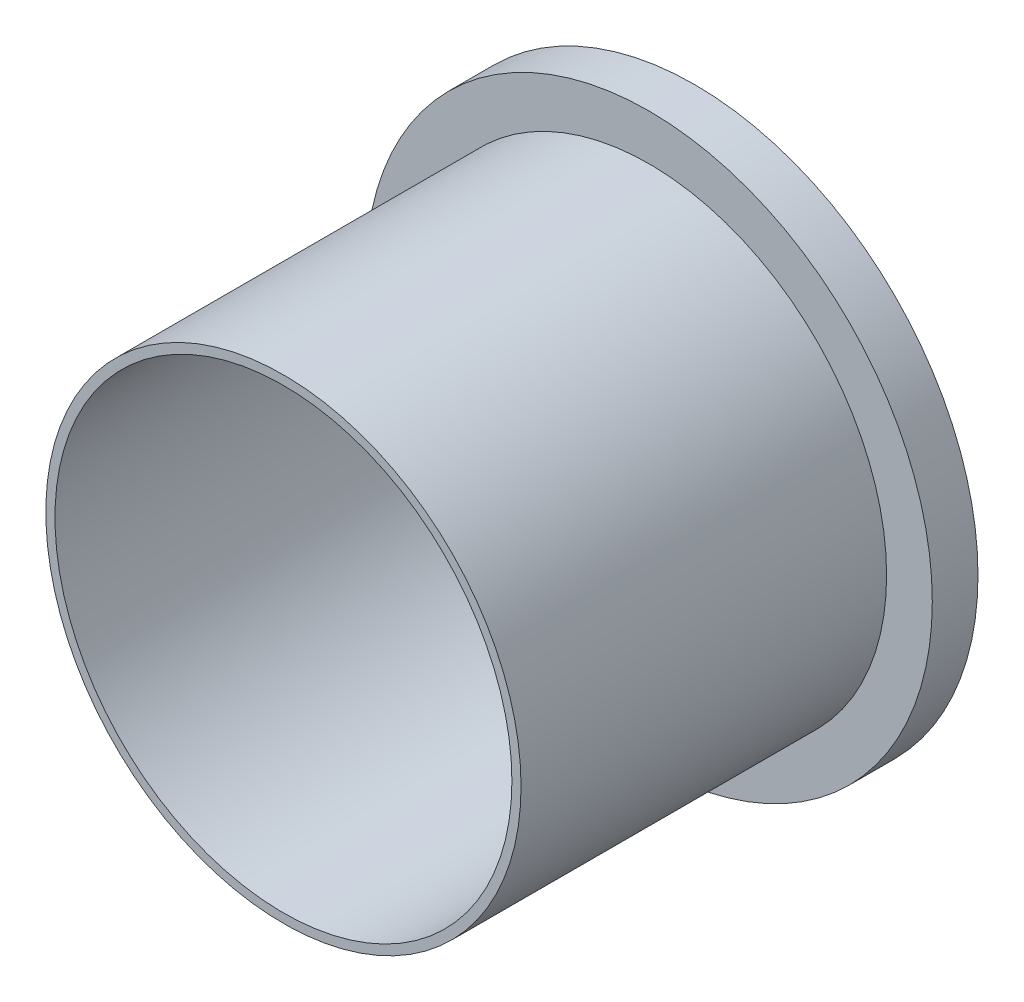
ISO-10303-21;
HEADER;
FILE_DESCRIPTION(('STEP AP214'),'2;1');
FILE_NAME('part.step','',(''),(''),'','','');
FILE_SCHEMA(('AUTOMOTIVE_DESIGN { 1 0 10303 214 1 1 1 1 }'));
ENDSEC;
DATA;
#1=APPLICATION_CONTEXT('core data for automotive mechanical design processes');
#2=APPLICATION_PROTOCOL_DEFINITION('international standard','automotive_design',2000,#1);
#3=PRODUCT_CONTEXT('',#1,'mechanical');
#4=PRODUCT('Part','Part','',(#3));
#5=PRODUCT_RELATED_PRODUCT_CATEGORY('part','',(#4));
#6=PRODUCT_DEFINITION_FORMATION('','',#4);
#7=PRODUCT_DEFINITION_CONTEXT('part definition',#1,'design');
#8=PRODUCT_DEFINITION('design','',#6,#7);
#9=PRODUCT_DEFINITION_SHAPE('','',#8);
#10=(LENGTH_UNIT() NAMED_UNIT(*) SI_UNIT(.MILLI.,.METRE.));
#11=(NAMED_UNIT(*) PLANE_ANGLE_UNIT() SI_UNIT($,.RADIAN.));
#12=(NAMED_UNIT(*) SI_UNIT($,.STERADIAN.) SOLID_ANGLE_UNIT());
#13=UNCERTAINTY_MEASURE_WITH_UNIT(LENGTH_MEASURE(1.E-05),#10,'distance_accuracy_value','');
#14=(GEOMETRIC_REPRESENTATION_CONTEXT(3) GLOBAL_UNCERTAINTY_ASSIGNED_CONTEXT((#13)) GLOBAL_UNIT_ASSIGNED_CONTEXT((#10,
#11,#12)) REPRESENTATION_CONTEXT('',''));
#15=CARTESIAN_POINT('',(0.,0.,0.));
#16=DIRECTION('',(0.,0.,1.));
#17=DIRECTION('',(1.,0.,0.));
#18=AXIS2_PLACEMENT_3D('',#15,#16,#17);
#19=CARTESIAN_POINT('',(0.,0.,5.));
#20=DIRECTION('',(0.,0.,-1.));
#21=DIRECTION('',(-1.,0.,0.));
#22=AXIS2_PLACEMENT_3D('',#19,#20,#21);
#23=CYLINDRICAL_SURFACE('',#22,31.);
#24=CARTESIAN_POINT('',(0.,0.,5.));
#25=DIRECTION('',(0.,0.,1.));
#26=DIRECTION('',(1.,0.,0.));
#27=AXIS2_PLACEMENT_3D('',#24,#25,#26);
#28=CIRCLE('',#27,31.);
#29=CARTESIAN_POINT('',(31.,0.,5.));
#30=VERTEX_POINT('',#29);
#31=EDGE_CURVE('E104',#30,#30,#28,.T.);
#32=ORIENTED_EDGE('',*,*,#31,.F.);
#33=EDGE_LOOP('',(#32));
#34=FACE_BOUND('',#33,.T.);
#35=CARTESIAN_POINT('',(0.,0.,0.));
#36=DIRECTION('',(0.,0.,1.));
#37=DIRECTION('',(1.,0.,0.));
#38=AXIS2_PLACEMENT_3D('',#35,#36,#37);
#39=CIRCLE('',#38,31.);
#40=CARTESIAN_POINT('',(31.,0.,0.));
#41=VERTEX_POINT('',#40);
#42=EDGE_CURVE('E78',#41,#41,#39,.T.);
#43=ORIENTED_EDGE('',*,*,#42,.T.);
#44=EDGE_LOOP('',(#43));
#45=FACE_BOUND('',#44,.T.);
#46=ADVANCED_FACE('F41',(#34,#45),#23,.T.);
#47=CARTESIAN_POINT('',(0.,0.,5.));
#48=DIRECTION('',(0.,0.,1.));
#49=DIRECTION('',(1.,0.,0.));
#50=AXIS2_PLACEMENT_3D('',#47,#48,#49);
#51=PLANE('',#50);
#52=CARTESIAN_POINT('',(0.,0.,5.));
#53=DIRECTION('',(0.,0.,1.));
#54=DIRECTION('',(1.,0.,0.));
#55=AXIS2_PLACEMENT_3D('',#52,#53,#54);
#56=CIRCLE('',#55,26.);
#57=CARTESIAN_POINT('',(26.,0.,5.));
#58=VERTEX_POINT('',#57);
#59=EDGE_CURVE('E49',#58,#58,#56,.T.);
#60=ORIENTED_EDGE('',*,*,#59,.F.);
#61=EDGE_LOOP('',(#60));
#62=FACE_BOUND('',#61,.T.);
#63=ORIENTED_EDGE('',*,*,#31,.T.);
#64=EDGE_LOOP('',(#63));
#65=FACE_BOUND('',#64,.T.);
#66=ADVANCED_FACE('F115',(#62,#65),#51,.T.);
#67=CARTESIAN_POINT('',(0.,0.,0.));
#68=DIRECTION('',(0.,0.,1.));
#69=DIRECTION('',(1.,0.,0.));
#70=AXIS2_PLACEMENT_3D('',#67,#68,#69);
#71=PLANE('',#70);
#72=CARTESIAN_POINT('',(0.,-26.7712106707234,0.));
#73=CARTESIAN_POINT('',(0.0951690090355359,-26.7712114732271,0.));
#74=CARTESIAN_POINT('',(0.190332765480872,-26.7667476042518,0.));
#75=CARTESIAN_POINT('',(0.379827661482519,-26.7490256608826,0.));
#76=CARTESIAN_POINT('',(0.474158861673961,-26.7357682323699,0.));
#77=CARTESIAN_POINT('',(0.661290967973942,-26.7008198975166,0.));
#78=CARTESIAN_POINT('',(0.754090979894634,-26.6791242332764,0.));
#79=CARTESIAN_POINT('',(0.937523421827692,-26.6278483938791,0.));
#80=CARTESIAN_POINT('',(1.02815463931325,-26.5982639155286,0.));
#81=CARTESIAN_POINT('',(1.22597101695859,-26.5247352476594,0.));
#82=CARTESIAN_POINT('',(1.33251701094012,-26.4790706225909,0.));
#83=CARTESIAN_POINT('',(1.54113763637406,-26.3783751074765,0.));
#84=CARTESIAN_POINT('',(1.64320897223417,-26.3233374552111,0.));
#85=CARTESIAN_POINT('',(1.84267739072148,-26.2051233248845,0.));
#86=CARTESIAN_POINT('',(1.94006822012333,-26.1419363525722,0.));
#87=CARTESIAN_POINT('',(2.12994875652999,-26.0086769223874,0.));
#88=CARTESIAN_POINT('',(2.22243956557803,-25.9386060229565,0.));
#89=CARTESIAN_POINT('',(2.45528216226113,-25.7499416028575,0.));
#90=CARTESIAN_POINT('',(2.59204397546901,-25.626906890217,0.));
#91=CARTESIAN_POINT('',(2.85435071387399,-25.3694101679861,0.));
#92=CARTESIAN_POINT('',(2.9798886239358,-25.2349411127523,0.));
#93=CARTESIAN_POINT('',(3.22084267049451,-24.9568653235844,0.));
#94=CARTESIAN_POINT('',(3.33624079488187,-24.8132430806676,0.));
#95=CARTESIAN_POINT('',(3.55764854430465,-24.5188962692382,0.));
#96=CARTESIAN_POINT('',(3.66365454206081,-24.3681689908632,0.));
#97=CARTESIAN_POINT('',(3.86296268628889,-24.0673134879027,0.));
#98=CARTESIAN_POINT('',(3.95660615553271,-23.9174101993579,0.));
#99=CARTESIAN_POINT('',(4.13666570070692,-23.6133783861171,0.));
#100=CARTESIAN_POINT('',(4.22308282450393,-23.4592504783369,0.));
#101=CARTESIAN_POINT('',(4.47257501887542,-22.9913566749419,0.));
#102=CARTESIAN_POINT('',(4.6257563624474,-22.6722886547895,0.));
#103=CARTESIAN_POINT('',(4.9097172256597,-22.0238877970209,0.));
#104=CARTESIAN_POINT('',(5.04045959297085,-21.6945389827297,0.));
#105=CARTESIAN_POINT('',(5.2820764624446,-21.0287745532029,0.));
#106=CARTESIAN_POINT('',(5.392956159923,-20.6923608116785,0.));
#107=CARTESIAN_POINT('',(5.59467986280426,-20.0219947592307,0.));
#108=CARTESIAN_POINT('',(5.68592355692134,-19.6881616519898,0.));
#109=CARTESIAN_POINT('',(5.85301692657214,-19.0166247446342,0.));
#110=CARTESIAN_POINT('',(5.92886393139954,-18.67892028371,0.));
#111=CARTESIAN_POINT('',(6.06633136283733,-18.0003672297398,0.));
#112=CARTESIAN_POINT('',(6.12794051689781,-17.6595163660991,0.));
#113=CARTESIAN_POINT('',(6.23770548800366,-16.9756860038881,0.));
#114=CARTESIAN_POINT('',(6.2858620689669,-16.6327066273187,0.));
#115=CARTESIAN_POINT('',(6.3694937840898,-15.9440382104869,0.));
#116=CARTESIAN_POINT('',(6.40492559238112,-15.5983439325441,0.));
#117=CARTESIAN_POINT('',(6.46332318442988,-14.9059013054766,0.));
#118=CARTESIAN_POINT('',(6.48628867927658,-14.5591529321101,0.));
#119=CARTESIAN_POINT('',(6.5200224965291,-13.8652237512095,0.));
#120=CARTESIAN_POINT('',(6.53079641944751,-13.5180432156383,0.));
#121=CARTESIAN_POINT('',(6.54029122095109,-12.8235401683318,0.));
#122=CARTESIAN_POINT('',(6.53901261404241,-12.4762176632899,0.));
#123=CARTESIAN_POINT('',(6.52122249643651,-11.6310035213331,0.));
#124=CARTESIAN_POINT('',(6.49833642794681,-11.1332312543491,0.));
#125=CARTESIAN_POINT('',(6.42719860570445,-10.1393540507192,0.));
#126=CARTESIAN_POINT('',(6.37893960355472,-9.64324963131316,0.));
#127=CARTESIAN_POINT('',(6.25575660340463,-8.65384936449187,0.));
#128=CARTESIAN_POINT('',(6.18080672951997,-8.16055671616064,0.));
#129=CARTESIAN_POINT('',(6.00252804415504,-7.18093065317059,0.));
#130=CARTESIAN_POINT('',(5.89930666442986,-6.69457808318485,0.));
#131=CARTESIAN_POINT('',(5.72080350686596,-5.97110568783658,0.));
#132=CARTESIAN_POINT('',(5.6573790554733,-5.73102625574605,0.));
#133=CARTESIAN_POINT('',(5.52209099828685,-5.25326547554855,0.));
#134=CARTESIAN_POINT('',(5.45022819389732,-5.01558390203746,0.));
#135=CARTESIAN_POINT('',(5.29753705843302,-4.54349751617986,0.));
#136=CARTESIAN_POINT('',(5.21672219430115,-4.30908836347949,0.));
#137=CARTESIAN_POINT('',(5.04526857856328,-3.84391383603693,0.));
#138=CARTESIAN_POINT('',(4.95463115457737,-3.61314797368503,0.));
#139=CARTESIAN_POINT('',(4.74871149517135,-3.12314981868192,0.));
#140=CARTESIAN_POINT('',(4.63176023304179,-2.864612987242,0.));
#141=CARTESIAN_POINT('',(4.38189982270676,-2.35519685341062,0.));
#142=CARTESIAN_POINT('',(4.24898557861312,-2.10432002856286,0.));
#143=CARTESIAN_POINT('',(3.96565607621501,-1.6141910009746,0.));
#144=CARTESIAN_POINT('',(3.81532860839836,-1.37488842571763,0.));
#145=CARTESIAN_POINT('',(3.49396375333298,-0.910684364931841,0.));
#146=CARTESIAN_POINT('',(3.32294855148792,-0.685767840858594,0.));
#147=CARTESIAN_POINT('',(3.06066738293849,-0.378078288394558,0.));
#148=CARTESIAN_POINT('',(2.97912570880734,-0.286981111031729,0.));
#149=CARTESIAN_POINT('',(2.8112676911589,-0.109338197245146,0.));
#150=CARTESIAN_POINT('',(2.72495175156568,-0.0227920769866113,0.));
#151=CARTESIAN_POINT('',(2.4580954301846,0.229137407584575,0.));
#152=CARTESIAN_POINT('',(2.26978250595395,0.386648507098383,0.));
#153=CARTESIAN_POINT('',(1.96980155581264,0.601276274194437,0.));
#154=CARTESIAN_POINT('',(1.86608154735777,0.669622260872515,0.));
#155=CARTESIAN_POINT('',(1.65308171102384,0.797158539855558,0.));
#156=CARTESIAN_POINT('',(1.54380144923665,0.856348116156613,0.));
#157=CARTESIAN_POINT('',(1.32035538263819,0.963817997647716,0.));
#158=CARTESIAN_POINT('',(1.20620442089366,1.01212897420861,0.));
#159=CARTESIAN_POINT('',(0.973445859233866,1.09643506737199,0.));
#160=CARTESIAN_POINT('',(0.854840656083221,1.13243670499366,0.));
#161=CARTESIAN_POINT('',(0.649624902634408,1.18216255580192,0.));
#162=CARTESIAN_POINT('',(0.563836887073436,1.19932381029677,0.));
#163=CARTESIAN_POINT('',(0.391133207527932,1.22642002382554,0.));
#164=CARTESIAN_POINT('',(0.304217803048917,1.2363566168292,0.));
#165=CARTESIAN_POINT('',(0.129879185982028,1.24876450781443,0.));
#166=CARTESIAN_POINT('',(0.0424561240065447,1.25123791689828,0.));
#167=CARTESIAN_POINT('',(-0.132282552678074,1.24866604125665,0.));
#168=CARTESIAN_POINT('',(-0.219598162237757,1.24362040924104,0.));
#169=CARTESIAN_POINT('',(-0.393336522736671,1.22614597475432,0.));
#170=CARTESIAN_POINT('',(-0.479760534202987,1.21372967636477,0.));
#171=CARTESIAN_POINT('',(-0.651272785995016,1.18182544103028,0.));
#172=CARTESIAN_POINT('',(-0.736361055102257,1.16233765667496,0.));
#173=CARTESIAN_POINT('',(-0.988955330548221,1.09385233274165,0.));
#174=CARTESIAN_POINT('',(-1.15379596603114,1.03483226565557,0.));
#175=CARTESIAN_POINT('',(-1.53861254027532,0.865728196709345,0.));
#176=CARTESIAN_POINT('',(-1.75371797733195,0.744637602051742,0.));
#177=CARTESIAN_POINT('',(-2.05975541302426,0.538884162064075,0.));
#178=CARTESIAN_POINT('',(-2.15914133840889,0.466146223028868,0.));
#179=CARTESIAN_POINT('',(-2.35252428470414,0.313812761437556,0.));
#180=CARTESIAN_POINT('',(-2.44652194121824,0.234218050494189,0.));
#181=CARTESIAN_POINT('',(-2.68873400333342,0.0156254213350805,0.));
#182=CARTESIAN_POINT('',(-2.83245865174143,-0.128345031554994,0.));
#183=CARTESIAN_POINT('',(-3.10692755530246,-0.428187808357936,0.));
#184=CARTESIAN_POINT('',(-3.23766277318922,-0.584068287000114,0.));
#185=CARTESIAN_POINT('',(-3.48756141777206,-0.905181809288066,0.));
#186=CARTESIAN_POINT('',(-3.60670612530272,-1.07042932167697,0.));
#187=CARTESIAN_POINT('',(-3.83442309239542,-1.40809818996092,0.));
#188=CARTESIAN_POINT('',(-3.94299127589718,-1.58052227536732,0.));
#189=CARTESIAN_POINT('',(-4.14848151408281,-1.92750753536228,0.));
#190=CARTESIAN_POINT('',(-4.24559288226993,-2.10195722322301,0.));
#191=CARTESIAN_POINT('',(-4.43145393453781,-2.45520568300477,0.));
#192=CARTESIAN_POINT('',(-4.52020475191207,-2.63400386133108,0.));
#193=CARTESIAN_POINT('',(-4.69015075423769,-2.99532822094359,0.));
#194=CARTESIAN_POINT('',(-4.77133949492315,-3.17785742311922,0.));
#195=CARTESIAN_POINT('',(-4.92668726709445,-3.54589207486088,0.));
#196=CARTESIAN_POINT('',(-5.0008454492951,-3.73139788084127,0.));
#197=CARTESIAN_POINT('',(-5.2138349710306,-4.29232953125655,0.));
#198=CARTESIAN_POINT('',(-5.34287283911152,-4.671501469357,0.));
#199=CARTESIAN_POINT('',(-5.57802847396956,-5.43664984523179,0.));
#200=CARTESIAN_POINT('',(-5.68415241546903,-5.82262441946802,0.));
#201=CARTESIAN_POINT('',(-5.90016924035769,-6.69799218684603,0.));
#202=CARTESIAN_POINT('',(-6.00421430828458,-7.18882885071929,0.));
#203=CARTESIAN_POINT('',(-6.1833661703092,-8.17602292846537,0.));
#204=CARTESIAN_POINT('',(-6.25845275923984,-8.67238394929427,0.));
#205=CARTESIAN_POINT('',(-6.38169160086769,-9.66861343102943,0.));
#206=CARTESIAN_POINT('',(-6.42983313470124,-10.1684832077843,0.));
#207=CARTESIAN_POINT('',(-6.50042986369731,-11.1706885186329,0.));
#208=CARTESIAN_POINT('',(-6.52285052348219,-11.6730264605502,0.));
#209=CARTESIAN_POINT('',(-6.54244382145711,-12.6779650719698,0.));
#210=CARTESIAN_POINT('',(-6.53962778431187,-13.1805655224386,0.));
#211=CARTESIAN_POINT('',(-6.5087094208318,-14.1848338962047,0.));
#212=CARTESIAN_POINT('',(-6.48061517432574,-14.6865020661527,0.));
#213=CARTESIAN_POINT('',(-6.39592815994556,-15.7184701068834,0.));
#214=CARTESIAN_POINT('',(-6.337691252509,-16.2486363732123,0.));
#215=CARTESIAN_POINT('',(-6.19021999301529,-17.3048453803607,0.));
#216=CARTESIAN_POINT('',(-6.10097954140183,-17.8308872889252,0.));
#217=CARTESIAN_POINT('',(-5.94193028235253,-18.6136232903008,0.));
#218=CARTESIAN_POINT('',(-5.88486120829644,-18.8729451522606,0.));
#219=CARTESIAN_POINT('',(-5.76180510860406,-19.389456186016,0.));
#220=CARTESIAN_POINT('',(-5.69581888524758,-19.6466455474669,0.));
#221=CARTESIAN_POINT('',(-5.55435113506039,-20.1582658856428,0.));
#222=CARTESIAN_POINT('',(-5.47887444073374,-20.4126981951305,0.));
#223=CARTESIAN_POINT('',(-5.31764753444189,-20.918263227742,0.));
#224=CARTESIAN_POINT('',(-5.23189891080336,-21.1693964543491,0.));
#225=CARTESIAN_POINT('',(-5.06415991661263,-21.6267035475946,0.));
#226=CARTESIAN_POINT('',(-4.98385927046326,-21.8334966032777,0.));
#227=CARTESIAN_POINT('',(-4.81473713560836,-22.243573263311,0.));
#228=CARTESIAN_POINT('',(-4.72591605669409,-22.4468570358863,0.));
#229=CARTESIAN_POINT('',(-4.5386674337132,-22.8496930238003,0.));
#230=CARTESIAN_POINT('',(-4.44021262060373,-23.049232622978,0.));
#231=CARTESIAN_POINT('',(-4.23293402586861,-23.442870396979,0.));
#232=CARTESIAN_POINT('',(-4.12411070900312,-23.6369688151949,0.));
#233=CARTESIAN_POINT('',(-3.89345580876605,-24.0206828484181,0.));
#234=CARTESIAN_POINT('',(-3.77147691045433,-24.2102105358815,0.));
#235=CARTESIAN_POINT('',(-3.51415506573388,-24.5801696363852,0.));
#236=CARTESIAN_POINT('',(-3.37880622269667,-24.7605969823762,0.));
#237=CARTESIAN_POINT('',(-3.09374883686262,-25.1085101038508,0.));
#238=CARTESIAN_POINT('',(-2.94410766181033,-25.2760504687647,0.));
#239=CARTESIAN_POINT('',(-2.62844253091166,-25.5946769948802,0.));
#240=CARTESIAN_POINT('',(-2.46244101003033,-25.7457851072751,0.));
#241=CARTESIAN_POINT('',(-2.1240283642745,-26.0165670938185,0.));
#242=CARTESIAN_POINT('',(-1.95278323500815,-26.1376653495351,0.));
#243=CARTESIAN_POINT('',(-1.68421141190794,-26.2998777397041,0.));
#244=CARTESIAN_POINT('',(-1.59271275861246,-26.350719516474,0.));
#245=CARTESIAN_POINT('',(-1.40598961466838,-26.4449825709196,0.));
#246=CARTESIAN_POINT('',(-1.31076691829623,-26.4884073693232,0.));
#247=CARTESIAN_POINT('',(-1.11755645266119,-26.5666296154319,0.));
#248=CARTESIAN_POINT('',(-1.01959112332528,-26.6014821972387,0.));
#249=CARTESIAN_POINT('',(-0.820851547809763,-26.6620211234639,0.));
#250=CARTESIAN_POINT('',(-0.720077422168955,-26.6877078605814,0.));
#251=CARTESIAN_POINT('',(-0.516615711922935,-26.7291210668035,0.));
#252=CARTESIAN_POINT('',(-0.413930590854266,-26.7448595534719,0.));
#253=CARTESIAN_POINT('',(-0.207494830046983,-26.765903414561,0.));
#254=CARTESIAN_POINT('',(-0.103744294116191,-26.7712097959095,0.));
#255=CARTESIAN_POINT('',(0.,-26.7712106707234,0.));
#256=B_SPLINE_CURVE_WITH_KNOTS('',3,(#72,#73,#74,#75,#76,#77,#78,#79,#80,#81,#82,#83,#84,#85,
#86,#87,#88,#89,#90,#91,#92,#93,#94,#95,#96,#97,#98,#99,#100,#101,#102,#103,#104,#105,#106,#107,
#108,#109,#110,#111,#112,#113,#114,#115,#116,#117,#118,#119,#120,#121,#122,#123,#124,#125,#126,
#127,#128,#129,#130,#131,#132,#133,#134,#135,#136,#137,#138,#139,#140,#141,#142,#143,#144,#145,
#146,#147,#148,#149,#150,#151,#152,#153,#154,#155,#156,#157,#158,#159,#160,#161,#162,#163,#164,
#165,#166,#167,#168,#169,#170,#171,#172,#173,#174,#175,#176,#177,#178,#179,#180,#181,#182,#183,
#184,#185,#186,#187,#188,#189,#190,#191,#192,#193,#194,#195,#196,#197,#198,#199,#200,#201,#202,
#203,#204,#205,#206,#207,#208,#209,#210,#211,#212,#213,#214,#215,#216,#217,#218,#219,#220,#221,
#222,#223,#224,#225,#226,#227,#228,#229,#230,#231,#232,#233,#234,#235,#236,#237,#238,#239,#240,
#241,#242,#243,#244,#245,#246,#247,#248,#249,#250,#251,#252,#253,#254,#255),.UNSPECIFIED.,.T.,
.F.,(4,2,2,2,2,2,2,2,2,2,2,2,2,2,2,2,2,2,2,2,2,2,2,2,2,2,2,2,2,2,2,2,2,2,2,2,2,2,2,2,2,2,2,2,2,
2,2,2,2,2,2,2,2,2,2,2,2,2,2,2,2,2,2,2,2,2,2,2,2,2,2,2,2,2,2,2,2,2,2,2,2,2,2,2,2,2,2,2,2,2,2,4),
(0.,0.28539490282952,0.570768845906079,0.856303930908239,1.1419950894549,1.48922227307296,
1.83670103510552,2.18463181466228,2.53248400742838,3.08346014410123,3.63477827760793,
4.18705675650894,4.73954760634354,5.26956916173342,5.79951372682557,6.86014331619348,
7.92251240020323,8.9846032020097,10.0224418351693,11.0604603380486,12.0992978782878,
13.1380764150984,14.1803590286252,15.222665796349,16.264493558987,17.3062768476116,
18.8005120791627,20.2951744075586,21.7912897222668,23.2817968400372,24.0266192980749,
24.7713710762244,25.5150173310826,26.2585631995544,27.1093646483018,27.9604384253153,
28.8073942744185,29.6534497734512,30.0200690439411,30.3866573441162,31.1204684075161,
31.4927484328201,31.8650575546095,32.2363034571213,32.6073523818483,32.8695374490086,
33.1316632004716,33.3937147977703,33.6557784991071,33.9173988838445,34.1790136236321,
34.7022277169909,35.4384222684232,35.8076862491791,36.1769065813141,36.7862104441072,
37.3959352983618,38.0066290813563,38.6175572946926,39.2162821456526,39.8149257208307,
40.4140748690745,41.0132963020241,42.2139417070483,43.4142631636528,44.9184695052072,
46.4237234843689,47.9295758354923,49.4374477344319,50.944643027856,52.4513567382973,
54.0505973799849,55.6501528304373,56.4466068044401,57.2429891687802,58.0389676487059,
58.8348232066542,59.5001655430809,60.1654758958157,60.8327271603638,61.4999485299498,
62.1756216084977,62.8515940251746,63.5245242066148,64.196544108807,64.8237414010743,
65.1374949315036,65.4510991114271,65.762630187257,66.0741479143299,66.385288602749,
66.6963992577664),.UNSPECIFIED.);
#257=CARTESIAN_POINT('',(-5.44374653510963,-5.,0.));
#258=VERTEX_POINT('',#257);
#259=CARTESIAN_POINT('',(5.44374653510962,-5.,0.));
#260=VERTEX_POINT('',#259);
#261=EDGE_CURVE('E54',#258,#260,#256,.T.);
#262=ORIENTED_EDGE('',*,*,#261,.T.);
#263=DIRECTION('',(-1.,0.,0.));
#264=VECTOR('',#263,1.);
#265=CARTESIAN_POINT('',(0.,-5.,0.));
#266=LINE('',#265,#264);
#267=EDGE_CURVE('E11',#260,#258,#266,.T.);
#268=ORIENTED_EDGE('',*,*,#267,.T.);
#269=EDGE_LOOP('',(#262,#268));
#270=FACE_BOUND('',#269,.T.);
#271=ORIENTED_EDGE('',*,*,#42,.F.);
#272=EDGE_LOOP('',(#271));
#273=FACE_BOUND('',#272,.T.);
#274=ADVANCED_FACE('F57',(#270,#273),#71,.F.);
#275=CARTESIAN_POINT('',(0.,0.,45.));
#276=DIRECTION('',(0.,0.,-1.));
#277=DIRECTION('',(-1.,0.,0.));
#278=AXIS2_PLACEMENT_3D('',#275,#276,#277);
#279=CYLINDRICAL_SURFACE('',#278,26.);
#280=CARTESIAN_POINT('',(0.,0.,45.));
#281=DIRECTION('',(0.,0.,1.));
#282=DIRECTION('',(1.,0.,0.));
#283=AXIS2_PLACEMENT_3D('',#280,#281,#282);
#284=CIRCLE('',#283,26.);
#285=CARTESIAN_POINT('',(26.,0.,45.));
#286=VERTEX_POINT('',#285);
#287=EDGE_CURVE('E98',#286,#286,#284,.T.);
#288=ORIENTED_EDGE('',*,*,#287,.F.);
#289=EDGE_LOOP('',(#288));
#290=FACE_BOUND('',#289,.T.);
#291=ORIENTED_EDGE('',*,*,#59,.T.);
#292=EDGE_LOOP('',(#291));
#293=FACE_BOUND('',#292,.T.);
#294=ADVANCED_FACE('F114',(#290,#293),#279,.T.);
#295=CARTESIAN_POINT('',(0.,0.,45.));
#296=DIRECTION('',(0.,0.,1.));
#297=DIRECTION('',(1.,0.,0.));
#298=AXIS2_PLACEMENT_3D('',#295,#296,#297);
#299=PLANE('',#298);
#300=CARTESIAN_POINT('',(0.,0.,45.));
#301=DIRECTION('',(0.,0.,1.));
#302=DIRECTION('',(1.,0.,0.));
#303=AXIS2_PLACEMENT_3D('',#300,#301,#302);
#304=CIRCLE('',#303,25.);
#305=CARTESIAN_POINT('',(25.,0.,45.));
#306=VERTEX_POINT('',#305);
#307=EDGE_CURVE('E68',#306,#306,#304,.T.);
#308=ORIENTED_EDGE('',*,*,#307,.F.);
#309=EDGE_LOOP('',(#308));
#310=FACE_BOUND('',#309,.T.);
#311=ORIENTED_EDGE('',*,*,#287,.T.);
#312=EDGE_LOOP('',(#311));
#313=FACE_BOUND('',#312,.T.);
#314=ADVANCED_FACE('F120',(#310,#313),#299,.T.);
#315=CARTESIAN_POINT('',(0.,0.,-65.7106781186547));
#316=DIRECTION('',(0.,0.,1.));
#317=DIRECTION('',(1.,0.,0.));
#318=AXIS2_PLACEMENT_3D('',#315,#316,#317);
#319=CYLINDRICAL_SURFACE('',#318,25.);
#320=CARTESIAN_POINT('',(0.,0.,5.));
#321=DIRECTION('',(0.,0.,1.));
#322=DIRECTION('',(1.,0.,0.));
#323=AXIS2_PLACEMENT_3D('',#320,#321,#322);
#324=CIRCLE('',#323,25.);
#325=CARTESIAN_POINT('',(25.,0.,5.));
#326=VERTEX_POINT('',#325);
#327=EDGE_CURVE('E71',#326,#326,#324,.F.);
#328=ORIENTED_EDGE('',*,*,#327,.T.);
#329=EDGE_LOOP('',(#328));
#330=FACE_BOUND('',#329,.T.);
#331=ORIENTED_EDGE('',*,*,#307,.T.);
#332=EDGE_LOOP('',(#331));
#333=FACE_BOUND('',#332,.T.);
#334=ADVANCED_FACE('F149',(#330,#333),#319,.F.);
#335=CARTESIAN_POINT('',(0.,0.,5.));
#336=DIRECTION('',(0.,0.,1.));
#337=DIRECTION('',(1.,0.,0.));
#338=AXIS2_PLACEMENT_3D('',#335,#336,#337);
#339=PLANE('',#338);
#340=ORIENTED_EDGE('',*,*,#327,.F.);
#341=EDGE_LOOP('',(#340));
#342=FACE_BOUND('',#341,.T.);
#343=ADVANCED_FACE('F87',(#342),#339,.T.);
#344=CARTESIAN_POINT('',(0.,-12.7604640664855,-2.5));
#345=DIRECTION('',(0.,0.,-1.));
#346=DIRECTION('',(0.,1.,0.));
#347=AXIS2_PLACEMENT_3D('',#344,#345,#346);
#348=ELLIPSE('',#347,15.,7.);
#349=TRIMMED_CURVE('',#348,(PARAMETER_VALUE(0.)),(PARAMETER_VALUE(3.14159265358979)),.T.,.PARAMETER.);
#350=CARTESIAN_POINT('',(0.,2.23953593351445,-2.5));
#351=DIRECTION('',(0.,1.,0.));
#352=AXIS1_PLACEMENT('',#350,#351);
#353=SURFACE_OF_REVOLUTION('',#349,#352);
#354=ORIENTED_EDGE('',*,*,#261,.F.);
#355=CARTESIAN_POINT('',(5.1061709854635,-2.50000000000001,-2.5));
#356=CARTESIAN_POINT('',(5.17862810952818,-2.66557841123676,-2.33442158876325));
#357=CARTESIAN_POINT('',(5.24073457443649,-2.83343263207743,-2.16656736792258));
#358=CARTESIAN_POINT('',(5.34457129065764,-3.17219352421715,-1.82780647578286));
#359=CARTESIAN_POINT('',(5.38630020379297,-3.34310039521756,-1.65689960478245));
#360=CARTESIAN_POINT('',(5.48129610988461,-3.858673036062,-1.141326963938));
#361=CARTESIAN_POINT('',(5.50447811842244,-4.20643801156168,-0.793561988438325));
#362=CARTESIAN_POINT('',(5.47928038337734,-4.72773754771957,-0.272262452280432));
#363=CARTESIAN_POINT('',(5.46063882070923,-4.90232154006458,-0.097678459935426));
#364=CARTESIAN_POINT('',(5.40289937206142,-5.24980648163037,0.24980648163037));
#365=CARTESIAN_POINT('',(5.3637997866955,-5.42270728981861,0.422707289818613));
#366=CARTESIAN_POINT('',(5.21545867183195,-5.93672501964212,0.936725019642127));
#367=CARTESIAN_POINT('',(5.07514773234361,-6.27376149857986,1.27376149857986));
#368=CARTESIAN_POINT('',(4.74888776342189,-6.85278643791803,1.85278643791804));
#369=CARTESIAN_POINT('',(4.57951551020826,-7.09949766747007,2.09949766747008));
#370=CARTESIAN_POINT('',(4.18686185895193,-7.57050216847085,2.57050216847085));
#371=CARTESIAN_POINT('',(3.96365277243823,-7.7948249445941,2.7948249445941));
#372=CARTESIAN_POINT('',(3.51449550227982,-8.16817644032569,3.16817644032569));
#373=CARTESIAN_POINT('',(3.29859389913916,-8.32319452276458,3.32319452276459));
#374=CARTESIAN_POINT('',(2.95040294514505,-8.53550566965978,3.53550566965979));
#375=CARTESIAN_POINT('',(2.83029068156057,-8.60290333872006,3.60290333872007));
#376=CARTESIAN_POINT('',(2.58227359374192,-8.73014238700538,3.73014238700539));
#377=CARTESIAN_POINT('',(2.45436987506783,-8.78998483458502,3.78998483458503));
#378=CARTESIAN_POINT('',(2.21150253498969,-8.89269022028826,3.89269022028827));
#379=CARTESIAN_POINT('',(2.09754896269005,-8.93675038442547,3.93675038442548));
#380=CARTESIAN_POINT('',(1.86500284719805,-9.01824282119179,4.01824282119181));
#381=CARTESIAN_POINT('',(1.74641113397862,-9.05567627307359,4.0556762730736));
#382=CARTESIAN_POINT('',(1.50524552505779,-9.12339343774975,4.12339343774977));
#383=CARTESIAN_POINT('',(1.38267286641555,-9.15367934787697,4.15367934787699));
#384=CARTESIAN_POINT('',(1.13427669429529,-9.20665799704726,4.20665799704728));
#385=CARTESIAN_POINT('',(1.00845313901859,-9.22935063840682,4.22935063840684));
#386=CARTESIAN_POINT('',(0.753922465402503,-9.26684854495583,4.26684854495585));
#387=CARTESIAN_POINT('',(0.625205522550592,-9.28162057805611,4.28162057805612));
#388=CARTESIAN_POINT('',(0.366405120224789,-9.30287529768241,4.30287529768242));
#389=CARTESIAN_POINT('',(0.236321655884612,-9.30935795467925,4.30935795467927));
#390=CARTESIAN_POINT('',(-0.0241257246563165,-9.31391717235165,4.31391717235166));
#391=CARTESIAN_POINT('',(-0.15448960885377,-9.31199464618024,4.31199464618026));
#392=CARTESIAN_POINT('',(-0.41442492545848,-9.29977998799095,4.29977998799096));
#393=CARTESIAN_POINT('',(-0.543996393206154,-9.28948823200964,4.28948823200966));
#394=CARTESIAN_POINT('',(-0.792278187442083,-9.2617290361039,4.26172903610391));
#395=CARTESIAN_POINT('',(-0.911113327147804,-9.24481499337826,4.24481499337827));
#396=CARTESIAN_POINT('',(-1.14645936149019,-9.20415372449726,4.20415372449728));
#397=CARTESIAN_POINT('',(-1.2629694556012,-9.18040418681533,4.18040418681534));
#398=CARTESIAN_POINT('',(-1.49289252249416,-9.12641069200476,4.12641069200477));
#399=CARTESIAN_POINT('',(-1.60630655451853,-9.096168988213,4.09616898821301));
#400=CARTESIAN_POINT('',(-1.82950582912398,-9.02957690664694,4.02957690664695));
#401=CARTESIAN_POINT('',(-1.93928970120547,-8.99322425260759,3.99322425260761));
#402=CARTESIAN_POINT('',(-2.27390783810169,-8.87143895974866,3.87143895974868));
#403=CARTESIAN_POINT('',(-2.49173566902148,-8.77618206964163,3.77618206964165));
#404=CARTESIAN_POINT('',(-2.90572273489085,-8.56459936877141,3.56459936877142));
#405=CARTESIAN_POINT('',(-3.10186878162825,-8.44826084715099,3.448260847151));
#406=CARTESIAN_POINT('',(-3.41793634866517,-8.23441148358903,3.23441148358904));
#407=CARTESIAN_POINT('',(-3.54358550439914,-8.1410698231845,3.14106982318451));
#408=CARTESIAN_POINT('',(-3.78291982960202,-7.94696780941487,2.94696780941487));
#409=CARTESIAN_POINT('',(-3.89660138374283,-7.84620522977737,2.84620522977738));
#410=CARTESIAN_POINT('',(-4.11206853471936,-7.63827876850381,2.63827876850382));
#411=CARTESIAN_POINT('',(-4.21383506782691,-7.53110503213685,2.53110503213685));
#412=CARTESIAN_POINT('',(-4.40532190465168,-7.31155342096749,2.3115534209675));
#413=CARTESIAN_POINT('',(-4.49504107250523,-7.19917505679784,2.19917505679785));
#414=CARTESIAN_POINT('',(-4.7880995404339,-6.79841525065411,1.79841525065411));
#415=CARTESIAN_POINT('',(-4.960538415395,-6.49832390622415,1.49832390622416));
#416=CARTESIAN_POINT('',(-5.1651511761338,-6.03694937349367,1.03694937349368));
#417=CARTESIAN_POINT('',(-5.22436706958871,-5.88118833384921,0.881188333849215));
#418=CARTESIAN_POINT('',(-5.32517638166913,-5.56683039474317,0.566830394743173));
#419=CARTESIAN_POINT('',(-5.36677075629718,-5.40823364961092,0.408233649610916));
#420=CARTESIAN_POINT('',(-5.46604368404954,-4.92650828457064,-0.0734917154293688));
#421=CARTESIAN_POINT('',(-5.49693612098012,-4.60036982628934,-0.399630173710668));
#422=CARTESIAN_POINT('',(-5.4904315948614,-4.1118270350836,-0.888172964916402));
#423=CARTESIAN_POINT('',(-5.47942986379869,-3.9489760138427,-1.05102398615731));
#424=CARTESIAN_POINT('',(-5.43973708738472,-3.6243545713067,-1.3756454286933));
#425=CARTESIAN_POINT('',(-5.41104394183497,-3.46258428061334,-1.53741571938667));
#426=CARTESIAN_POINT('',(-5.29083667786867,-2.9492688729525,-2.05073112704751));
#427=CARTESIAN_POINT('',(-5.1652036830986,-2.60117782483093,-2.39882217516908));
#428=CARTESIAN_POINT('',(-4.91056384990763,-2.09659685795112,-2.9034031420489));
#429=CARTESIAN_POINT('',(-4.81470485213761,-1.93139305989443,-3.06860694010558));
#430=CARTESIAN_POINT('',(-4.60032120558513,-1.60829387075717,-3.39170612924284));
#431=CARTESIAN_POINT('',(-4.48177861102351,-1.45040438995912,-3.5495956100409));
#432=CARTESIAN_POINT('',(-4.17611443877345,-1.09084914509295,-3.90915085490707));
#433=CARTESIAN_POINT('',(-3.97948980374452,-0.893100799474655,-4.10689920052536));
#434=CARTESIAN_POINT('',(-3.65309475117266,-0.615095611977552,-4.38490438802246));
#435=CARTESIAN_POINT('',(-3.5389828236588,-0.525486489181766,-4.47451351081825));
#436=CARTESIAN_POINT('',(-3.30038473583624,-0.353493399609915,-4.64650660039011));
#437=CARTESIAN_POINT('',(-3.17590486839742,-0.271105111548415,-4.72889488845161));
#438=CARTESIAN_POINT('',(-2.93986716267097,-0.128546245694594,-4.87145375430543));
#439=CARTESIAN_POINT('',(-2.82993395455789,-0.0670269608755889,-4.93297303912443));
#440=CARTESIAN_POINT('',(-2.60360004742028,0.0496847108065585,-5.04968471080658));
#441=CARTESIAN_POINT('',(-2.48720254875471,0.104880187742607,-5.10488018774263));
#442=CARTESIAN_POINT('',(-2.24856001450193,0.208187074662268,-5.20818707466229));
#443=CARTESIAN_POINT('',(-2.12632611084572,0.256311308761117,-5.25631130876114));
#444=CARTESIAN_POINT('',(-1.87647362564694,0.344892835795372,-5.34489283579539));
#445=CARTESIAN_POINT('',(-1.74885745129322,0.38535351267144,-5.38535351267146));
#446=CARTESIAN_POINT('',(-1.48785916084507,0.458298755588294,-5.45829875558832));
#447=CARTESIAN_POINT('',(-1.35443693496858,0.490711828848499,-5.49071182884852));
#448=CARTESIAN_POINT('',(-1.08391007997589,0.546512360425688,-5.54651236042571));
#449=CARTESIAN_POINT('',(-0.946806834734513,0.569903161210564,-5.56990316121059));
#450=CARTESIAN_POINT('',(-0.670097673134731,0.607212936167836,-5.60721293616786));
#451=CARTESIAN_POINT('',(-0.530492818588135,0.621135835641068,-5.62113583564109));
#452=CARTESIAN_POINT('',(-0.250019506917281,0.639237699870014,-5.63923769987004));
#453=CARTESIAN_POINT('',(-0.109151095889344,0.643417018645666,-5.64341701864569));
#454=CARTESIAN_POINT('',(0.155587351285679,0.642035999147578,-5.6420359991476));
#455=CARTESIAN_POINT('',(0.279471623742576,0.637582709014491,-5.63758270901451));
#456=CARTESIAN_POINT('',(0.526276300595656,0.621135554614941,-5.62113555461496));
#457=CARTESIAN_POINT('',(0.64919638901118,0.609139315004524,-5.60913931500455));
#458=CARTESIAN_POINT('',(0.893083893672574,0.577801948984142,-5.57780194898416));
#459=CARTESIAN_POINT('',(1.01405218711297,0.558464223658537,-5.55846422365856));
#460=CARTESIAN_POINT('',(1.25333906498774,0.512727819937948,-5.51272781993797));
#461=CARTESIAN_POINT('',(1.37165645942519,0.486326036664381,-5.4863260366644));
#462=CARTESIAN_POINT('',(1.60390143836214,0.427089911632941,-5.42708991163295));
#463=CARTESIAN_POINT('',(1.717857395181,0.394311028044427,-5.39431102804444));
#464=CARTESIAN_POINT('',(1.9418341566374,0.322604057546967,-5.32260405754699));
#465=CARTESIAN_POINT('',(2.0518545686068,0.283675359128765,-5.28367535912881));
#466=CARTESIAN_POINT('',(2.26746619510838,0.200128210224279,-5.20012821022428));
#467=CARTESIAN_POINT('',(2.37305788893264,0.155510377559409,-5.15551037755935));
#468=CARTESIAN_POINT('',(2.57947674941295,0.0610458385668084,-5.06104583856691));
#469=CARTESIAN_POINT('',(2.68030205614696,0.01119711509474,-5.01119711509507));
#470=CARTESIAN_POINT('',(2.99935063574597,-0.158352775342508,-4.84164722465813));
#471=CARTESIAN_POINT('',(3.2074436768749,-0.28774983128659,-4.71225016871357));
#472=CARTESIAN_POINT('',(3.59636941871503,-0.565707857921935,-4.43429214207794));
#473=CARTESIAN_POINT('',(3.77716251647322,-0.714296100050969,-4.2857038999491));
#474=CARTESIAN_POINT('',(4.07436823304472,-0.992120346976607,-4.00787965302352));
#475=CARTESIAN_POINT('',(4.19621507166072,-1.11848637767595,-3.88151362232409));
#476=CARTESIAN_POINT('',(4.42293884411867,-1.37845369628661,-3.62154630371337));
#477=CARTESIAN_POINT('',(4.5278296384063,-1.51204895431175,-3.48795104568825));
#478=CARTESIAN_POINT('',(4.72120500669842,-1.78540533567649,-3.21459466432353));
#479=CARTESIAN_POINT('',(4.80965160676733,-1.92517983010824,-3.07482016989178));
#480=CARTESIAN_POINT('',(4.97014857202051,-2.20937730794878,-2.79062269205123));
#481=CARTESIAN_POINT('',(5.04219452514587,-2.35380153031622,-2.64619846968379));
#482=CARTESIAN_POINT('',(5.1061709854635,-2.50000000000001,-2.5));
#483=B_SPLINE_CURVE_WITH_KNOTS('',3,(#355,#356,#357,#358,#359,#360,#361,#362,#363,#364,#365,
#366,#367,#368,#369,#370,#371,#372,#373,#374,#375,#376,#377,#378,#379,#380,#381,#382,#383,#384,
#385,#386,#387,#388,#389,#390,#391,#392,#393,#394,#395,#396,#397,#398,#399,#400,#401,#402,#403,
#404,#405,#406,#407,#408,#409,#410,#411,#412,#413,#414,#415,#416,#417,#418,#419,#420,#421,#422,
#423,#424,#425,#426,#427,#428,#429,#430,#431,#432,#433,#434,#435,#436,#437,#438,#439,#440,#441,
#442,#443,#444,#445,#446,#447,#448,#449,#450,#451,#452,#453,#454,#455,#456,#457,#458,#459,#460,
#461,#462,#463,#464,#465,#466,#467,#468,#469,#470,#471,#472,#473,#474,#475,#476,#477,#478,#479,
#480,#481,#482),.UNSPECIFIED.,.T.,.F.,(4,2,2,2,2,2,2,2,2,2,2,2,2,2,2,2,2,2,2,2,2,2,2,2,2,2,2,2,
2,2,2,2,2,2,2,2,2,2,2,2,2,2,2,2,2,2,2,2,2,2,2,2,2,2,2,2,2,2,2,2,2,2,2,4),(0.,0.735122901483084,
1.47029407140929,2.93955348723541,3.68167198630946,4.42385214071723,5.90567868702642,
7.0650286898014,8.22283008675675,9.14199941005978,9.60152979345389,10.0609951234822,
10.4502362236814,10.8394079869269,11.2284599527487,11.6175169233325,12.0081937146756,
12.3988718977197,12.7895076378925,13.1801258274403,13.5433703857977,13.9067379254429,
14.269979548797,14.6333567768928,15.398517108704,16.1641403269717,16.7101888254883,
17.2564018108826,17.8034771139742,18.350603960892,19.716526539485,20.4003069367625,
21.0840502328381,22.4643877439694,23.1555288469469,23.8467520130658,25.3612495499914,
26.1178802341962,26.8751120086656,27.8962095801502,28.4073140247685,28.9181104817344,
29.33829946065,29.7582822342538,30.177493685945,30.5965195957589,31.0191445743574,
31.4416128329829,31.8639058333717,32.2861834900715,32.6578617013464,33.0296570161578,
33.4012802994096,33.7730671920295,34.1417547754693,34.510479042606,34.8791633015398,
35.2479902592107,36.0760314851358,36.9052626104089,37.5532248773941,38.2006547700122,
38.8495616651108,39.4986429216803),.UNSPECIFIED.);
#484=EDGE_CURVE('E61',#260,#258,#483,.T.);
#485=ORIENTED_EDGE('',*,*,#484,.F.);
#486=EDGE_LOOP('',(#354,#485));
#487=FACE_BOUND('',#486,.T.);
#488=ADVANCED_FACE('F66',(#487),#353,.T.);
#489=CARTESIAN_POINT('',(0.,-5.,0.));
#490=DIRECTION('',(0.,-0.707106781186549,-0.707106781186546));
#491=DIRECTION('',(0.,0.707106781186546,-0.707106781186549));
#492=AXIS2_PLACEMENT_3D('',#489,#490,#491);
#493=PLANE('',#492);
#494=ORIENTED_EDGE('',*,*,#267,.F.);
#495=ORIENTED_EDGE('',*,*,#484,.T.);
#496=EDGE_LOOP('',(#494,#495));
#497=FACE_BOUND('',#496,.T.);
#498=ADVANCED_FACE('F62',(#497),#493,.T.);
#499=CLOSED_SHELL('',(#46,#66,#274,#294,#314,#334,#343,#488,#498));
#500=MANIFOLD_SOLID_BREP('B2',#499);
#501=ADVANCED_BREP_SHAPE_REPRESENTATION('',(#18,#500),#14);
#502=SHAPE_DEFINITION_REPRESENTATION(#9,#501);
ENDSEC;
END-ISO-10303-21;
